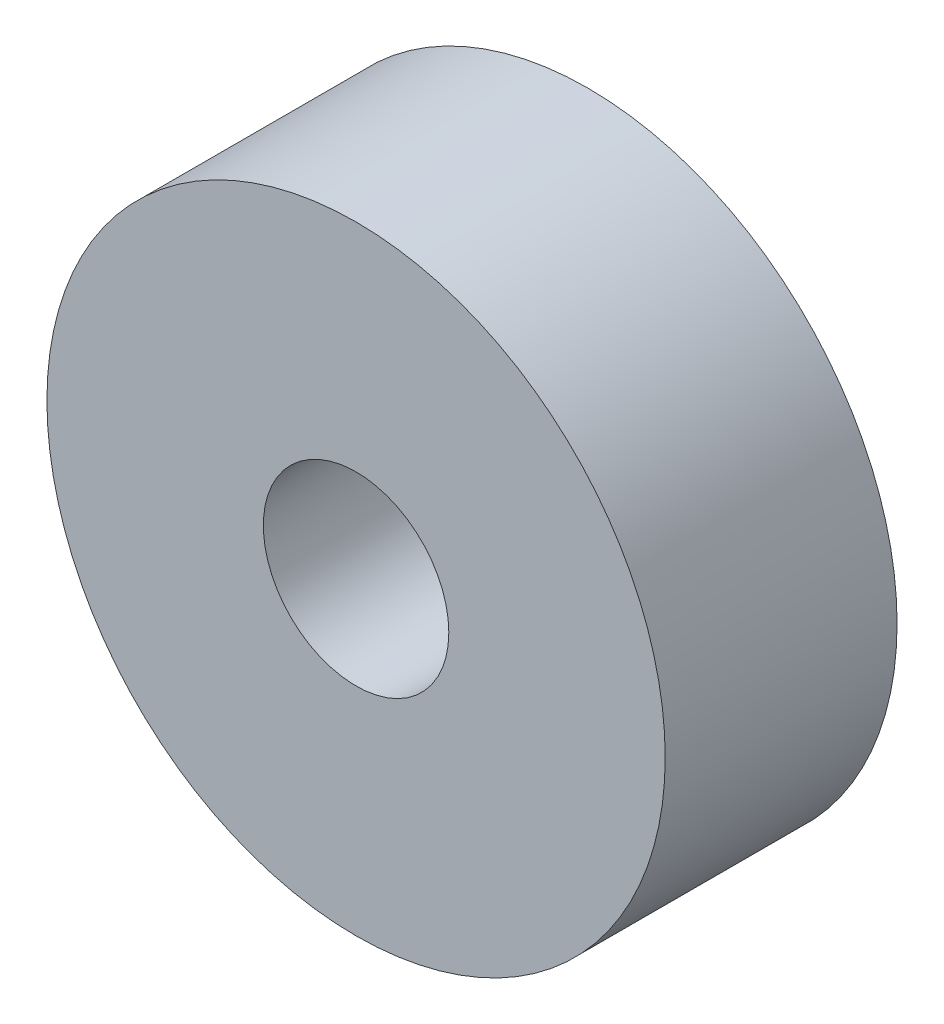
from build123d import *

# Parameters (mm, degrees)
SKETCH1_R        = 20
SKETCH1_R_2      = 6
EXTRUSION1_DEPTH = 15


with BuildPart() as part:
    # Sketch1 → Extrusion1 (new body)
    with BuildSketch(Plane.XY):
        Circle(SKETCH1_R)
        Circle(SKETCH1_R_2, mode=Mode.SUBTRACT)
    extrude(amount=EXTRUSION1_DEPTH)


solid = part.part
